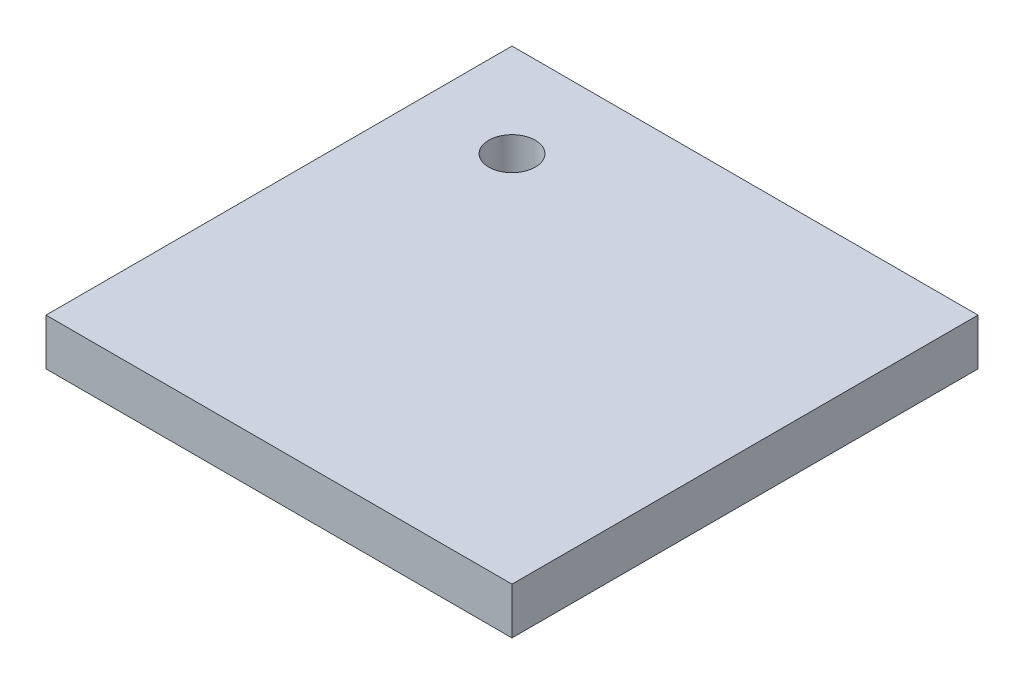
ISO-10303-21;
HEADER;
FILE_DESCRIPTION(('STEP AP214'),'2;1');
FILE_NAME('part.step','',(''),(''),'','','');
FILE_SCHEMA(('AUTOMOTIVE_DESIGN { 1 0 10303 214 1 1 1 1 }'));
ENDSEC;
DATA;
#1=APPLICATION_CONTEXT('core data for automotive mechanical design processes');
#2=APPLICATION_PROTOCOL_DEFINITION('international standard','automotive_design',2000,#1);
#3=PRODUCT_CONTEXT('',#1,'mechanical');
#4=PRODUCT('Part','Part','',(#3));
#5=PRODUCT_RELATED_PRODUCT_CATEGORY('part','',(#4));
#6=PRODUCT_DEFINITION_FORMATION('','',#4);
#7=PRODUCT_DEFINITION_CONTEXT('part definition',#1,'design');
#8=PRODUCT_DEFINITION('design','',#6,#7);
#9=PRODUCT_DEFINITION_SHAPE('','',#8);
#10=(LENGTH_UNIT() NAMED_UNIT(*) SI_UNIT(.MILLI.,.METRE.));
#11=(NAMED_UNIT(*) PLANE_ANGLE_UNIT() SI_UNIT($,.RADIAN.));
#12=(NAMED_UNIT(*) SI_UNIT($,.STERADIAN.) SOLID_ANGLE_UNIT());
#13=UNCERTAINTY_MEASURE_WITH_UNIT(LENGTH_MEASURE(1.E-05),#10,'distance_accuracy_value','');
#14=(GEOMETRIC_REPRESENTATION_CONTEXT(3) GLOBAL_UNCERTAINTY_ASSIGNED_CONTEXT((#13)) GLOBAL_UNIT_ASSIGNED_CONTEXT((#10,
#11,#12)) REPRESENTATION_CONTEXT('',''));
#15=CARTESIAN_POINT('',(0.,0.,0.));
#16=DIRECTION('',(0.,0.,1.));
#17=DIRECTION('',(1.,0.,0.));
#18=AXIS2_PLACEMENT_3D('',#15,#16,#17);
#19=CARTESIAN_POINT('',(0.,10.,0.));
#20=DIRECTION('',(1.,0.,0.));
#21=DIRECTION('',(0.,0.,-1.));
#22=AXIS2_PLACEMENT_3D('',#19,#20,#21);
#23=PLANE('',#22);
#24=DIRECTION('',(0.,0.,1.));
#25=VECTOR('',#24,1.);
#26=CARTESIAN_POINT('',(0.,0.,0.));
#27=LINE('',#26,#25);
#28=CARTESIAN_POINT('',(0.,0.,-100.));
#29=VERTEX_POINT('',#28);
#30=CARTESIAN_POINT('',(0.,0.,0.));
#31=VERTEX_POINT('',#30);
#32=EDGE_CURVE('E93',#29,#31,#27,.T.);
#33=ORIENTED_EDGE('',*,*,#32,.T.);
#34=DIRECTION('',(0.,-1.,0.));
#35=VECTOR('',#34,1.);
#36=CARTESIAN_POINT('',(0.,10.,0.));
#37=LINE('',#36,#35);
#38=CARTESIAN_POINT('',(0.,10.,0.));
#39=VERTEX_POINT('',#38);
#40=EDGE_CURVE('E11',#39,#31,#37,.T.);
#41=ORIENTED_EDGE('',*,*,#40,.F.);
#42=DIRECTION('',(0.,0.,1.));
#43=VECTOR('',#42,1.);
#44=CARTESIAN_POINT('',(0.,10.,0.));
#45=LINE('',#44,#43);
#46=CARTESIAN_POINT('',(0.,10.,-100.));
#47=VERTEX_POINT('',#46);
#48=EDGE_CURVE('E81',#47,#39,#45,.T.);
#49=ORIENTED_EDGE('',*,*,#48,.F.);
#50=DIRECTION('',(0.,-1.,0.));
#51=VECTOR('',#50,1.);
#52=CARTESIAN_POINT('',(0.,10.,-100.));
#53=LINE('',#52,#51);
#54=EDGE_CURVE('E89',#47,#29,#53,.T.);
#55=ORIENTED_EDGE('',*,*,#54,.T.);
#56=EDGE_LOOP('',(#33,#41,#49,#55));
#57=FACE_BOUND('',#56,.T.);
#58=ADVANCED_FACE('F30',(#57),#23,.F.);
#59=CARTESIAN_POINT('',(0.,10.,0.));
#60=DIRECTION('',(0.,0.,-1.));
#61=DIRECTION('',(-1.,0.,0.));
#62=AXIS2_PLACEMENT_3D('',#59,#60,#61);
#63=PLANE('',#62);
#64=DIRECTION('',(1.,0.,0.));
#65=VECTOR('',#64,1.);
#66=CARTESIAN_POINT('',(0.,0.,0.));
#67=LINE('',#66,#65);
#68=CARTESIAN_POINT('',(100.,0.,0.));
#69=VERTEX_POINT('',#68);
#70=EDGE_CURVE('E85',#31,#69,#67,.T.);
#71=ORIENTED_EDGE('',*,*,#70,.T.);
#72=DIRECTION('',(0.,-1.,0.));
#73=VECTOR('',#72,1.);
#74=CARTESIAN_POINT('',(100.,10.,0.));
#75=LINE('',#74,#73);
#76=CARTESIAN_POINT('',(100.,10.,0.));
#77=VERTEX_POINT('',#76);
#78=EDGE_CURVE('E38',#77,#69,#75,.T.);
#79=ORIENTED_EDGE('',*,*,#78,.F.);
#80=DIRECTION('',(1.,0.,0.));
#81=VECTOR('',#80,1.);
#82=CARTESIAN_POINT('',(0.,10.,0.));
#83=LINE('',#82,#81);
#84=EDGE_CURVE('E76',#39,#77,#83,.T.);
#85=ORIENTED_EDGE('',*,*,#84,.F.);
#86=ORIENTED_EDGE('',*,*,#40,.T.);
#87=EDGE_LOOP('',(#71,#79,#85,#86));
#88=FACE_BOUND('',#87,.T.);
#89=ADVANCED_FACE('F84',(#88),#63,.F.);
#90=CARTESIAN_POINT('',(100.,10.,0.));
#91=DIRECTION('',(-1.,0.,0.));
#92=DIRECTION('',(0.,0.,1.));
#93=AXIS2_PLACEMENT_3D('',#90,#91,#92);
#94=PLANE('',#93);
#95=DIRECTION('',(0.,0.,-1.));
#96=VECTOR('',#95,1.);
#97=CARTESIAN_POINT('',(100.,0.,0.));
#98=LINE('',#97,#96);
#99=CARTESIAN_POINT('',(100.,0.,-100.));
#100=VERTEX_POINT('',#99);
#101=EDGE_CURVE('E63',#69,#100,#98,.T.);
#102=ORIENTED_EDGE('',*,*,#101,.T.);
#103=DIRECTION('',(0.,-1.,0.));
#104=VECTOR('',#103,1.);
#105=CARTESIAN_POINT('',(100.,10.,-100.));
#106=LINE('',#105,#104);
#107=CARTESIAN_POINT('',(100.,10.,-100.));
#108=VERTEX_POINT('',#107);
#109=EDGE_CURVE('E86',#108,#100,#106,.T.);
#110=ORIENTED_EDGE('',*,*,#109,.F.);
#111=DIRECTION('',(0.,0.,-1.));
#112=VECTOR('',#111,1.);
#113=CARTESIAN_POINT('',(100.,10.,0.));
#114=LINE('',#113,#112);
#115=EDGE_CURVE('E79',#77,#108,#114,.T.);
#116=ORIENTED_EDGE('',*,*,#115,.F.);
#117=ORIENTED_EDGE('',*,*,#78,.T.);
#118=EDGE_LOOP('',(#102,#110,#116,#117));
#119=FACE_BOUND('',#118,.T.);
#120=ADVANCED_FACE('F87',(#119),#94,.F.);
#121=CARTESIAN_POINT('',(0.,10.,-100.));
#122=DIRECTION('',(0.,0.,1.));
#123=DIRECTION('',(1.,0.,0.));
#124=AXIS2_PLACEMENT_3D('',#121,#122,#123);
#125=PLANE('',#124);
#126=DIRECTION('',(-1.,0.,0.));
#127=VECTOR('',#126,1.);
#128=CARTESIAN_POINT('',(0.,0.,-100.));
#129=LINE('',#128,#127);
#130=EDGE_CURVE('E69',#100,#29,#129,.T.);
#131=ORIENTED_EDGE('',*,*,#130,.T.);
#132=ORIENTED_EDGE('',*,*,#54,.F.);
#133=DIRECTION('',(-1.,0.,0.));
#134=VECTOR('',#133,1.);
#135=CARTESIAN_POINT('',(0.,10.,-100.));
#136=LINE('',#135,#134);
#137=EDGE_CURVE('E46',#108,#47,#136,.T.);
#138=ORIENTED_EDGE('',*,*,#137,.F.);
#139=ORIENTED_EDGE('',*,*,#109,.T.);
#140=EDGE_LOOP('',(#131,#132,#138,#139));
#141=FACE_BOUND('',#140,.T.);
#142=ADVANCED_FACE('F101',(#141),#125,.F.);
#143=CARTESIAN_POINT('',(0.,10.,-100.));
#144=DIRECTION('',(0.,-1.,0.));
#145=DIRECTION('',(0.,0.,-1.));
#146=AXIS2_PLACEMENT_3D('',#143,#144,#145);
#147=PLANE('',#146);
#148=CARTESIAN_POINT('',(20.,10.,-80.));
#149=DIRECTION('',(0.,1.,0.));
#150=DIRECTION('',(0.,0.,1.));
#151=AXIS2_PLACEMENT_3D('',#148,#149,#150);
#152=CIRCLE('',#151,5.);
#153=CARTESIAN_POINT('',(20.,10.,-75.));
#154=VERTEX_POINT('',#153);
#155=EDGE_CURVE('E109',#154,#154,#152,.T.);
#156=ORIENTED_EDGE('',*,*,#155,.F.);
#157=EDGE_LOOP('',(#156));
#158=FACE_BOUND('',#157,.T.);
#159=ORIENTED_EDGE('',*,*,#48,.T.);
#160=ORIENTED_EDGE('',*,*,#84,.T.);
#161=ORIENTED_EDGE('',*,*,#115,.T.);
#162=ORIENTED_EDGE('',*,*,#137,.T.);
#163=EDGE_LOOP('',(#159,#160,#161,#162));
#164=FACE_BOUND('',#163,.T.);
#165=ADVANCED_FACE('F77',(#158,#164),#147,.F.);
#166=CARTESIAN_POINT('',(0.,0.,-100.));
#167=DIRECTION('',(0.,-1.,0.));
#168=DIRECTION('',(0.,0.,-1.));
#169=AXIS2_PLACEMENT_3D('',#166,#167,#168);
#170=PLANE('',#169);
#171=CARTESIAN_POINT('',(20.,0.,-80.));
#172=DIRECTION('',(0.,1.,0.));
#173=DIRECTION('',(0.,0.,1.));
#174=AXIS2_PLACEMENT_3D('',#171,#172,#173);
#175=CIRCLE('',#174,5.);
#176=CARTESIAN_POINT('',(20.,0.,-75.));
#177=VERTEX_POINT('',#176);
#178=EDGE_CURVE('E96',#177,#177,#175,.T.);
#179=ORIENTED_EDGE('',*,*,#178,.T.);
#180=EDGE_LOOP('',(#179));
#181=FACE_BOUND('',#180,.T.);
#182=ORIENTED_EDGE('',*,*,#32,.F.);
#183=ORIENTED_EDGE('',*,*,#130,.F.);
#184=ORIENTED_EDGE('',*,*,#101,.F.);
#185=ORIENTED_EDGE('',*,*,#70,.F.);
#186=EDGE_LOOP('',(#182,#183,#184,#185));
#187=FACE_BOUND('',#186,.T.);
#188=ADVANCED_FACE('F104',(#181,#187),#170,.T.);
#189=CARTESIAN_POINT('',(20.,10.,-80.));
#190=DIRECTION('',(0.,1.,0.));
#191=DIRECTION('',(0.,0.,1.));
#192=AXIS2_PLACEMENT_3D('',#189,#190,#191);
#193=CYLINDRICAL_SURFACE('',#192,5.);
#194=ORIENTED_EDGE('',*,*,#178,.F.);
#195=EDGE_LOOP('',(#194));
#196=FACE_BOUND('',#195,.T.);
#197=ORIENTED_EDGE('',*,*,#155,.T.);
#198=EDGE_LOOP('',(#197));
#199=FACE_BOUND('',#198,.T.);
#200=ADVANCED_FACE('F113',(#196,#199),#193,.F.);
#201=CLOSED_SHELL('',(#58,#89,#120,#142,#165,#188,#200));
#202=MANIFOLD_SOLID_BREP('B2',#201);
#203=ADVANCED_BREP_SHAPE_REPRESENTATION('',(#18,#202),#14);
#204=SHAPE_DEFINITION_REPRESENTATION(#9,#203);
ENDSEC;
END-ISO-10303-21;
